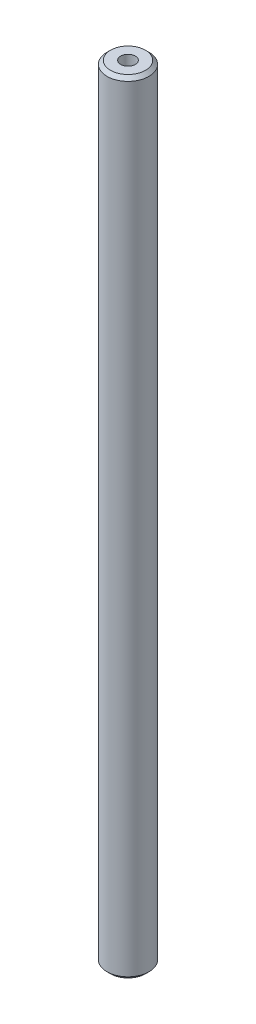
from build123d import *

# Parameters (mm, degrees)
SKETCH1_R                 = 6
EXTRUDE1_DEPTH            = 224
CHAMFER1_SIZE             = 1
M5X0_8_TAPPED_HOLE1_D     = 4.2
M5X0_8_TAPPED_HOLE1_DEPTH = 12.4
M5X0_8_TAPPED_HOLE1_TIP   = 1.2618073
M5X0_8_TAPPED_HOLE2_D     = 4.2
M5X0_8_TAPPED_HOLE2_DEPTH = 12.4
M5X0_8_TAPPED_HOLE2_TIP   = 1.2618073


with BuildPart() as part:
    # Sketch1 → Extrude1 (new body)
    with BuildSketch(Plane(origin=(0, 0, 0), x_dir=(1, 0, 0), z_dir=(0, 1, 0))):
        with Locations(Location((0, 0, 0), (0, 0, 270))):
            Circle(SKETCH1_R)
    extrude(amount=EXTRUDE1_DEPTH)

    # Chamfer1
    chamfer1_edges = [part.edges().sort_by_distance(p)[0] for p in [
        (0, 0, -6),
        (0, 224, -6),
    ]]
    chamfer(chamfer1_edges, length=CHAMFER1_SIZE)

    # M5x0.8 Tapped Hole1
    with Locations(Plane(origin=(0, 224, 0), x_dir=(-1, 0, 0), z_dir=(0, 1, 0))):
        with Locations((0, 0)):
            Hole(M5X0_8_TAPPED_HOLE1_D / 2, depth=M5X0_8_TAPPED_HOLE1_DEPTH)
            with Locations((0, 0, -(M5X0_8_TAPPED_HOLE1_DEPTH + M5X0_8_TAPPED_HOLE1_TIP / 2))):  # 118° drill point
                Cone(0, M5X0_8_TAPPED_HOLE1_D / 2, M5X0_8_TAPPED_HOLE1_TIP, mode=Mode.SUBTRACT)

    # M5x0.8 Tapped Hole2
    with Locations(Plane.XZ):
        with Locations((0, 0)):
            Hole(M5X0_8_TAPPED_HOLE2_D / 2, depth=M5X0_8_TAPPED_HOLE2_DEPTH)
            with Locations((0, 0, -(M5X0_8_TAPPED_HOLE2_DEPTH + M5X0_8_TAPPED_HOLE2_TIP / 2))):  # 118° drill point
                Cone(0, M5X0_8_TAPPED_HOLE2_D / 2, M5X0_8_TAPPED_HOLE2_TIP, mode=Mode.SUBTRACT)


solid = part.part
